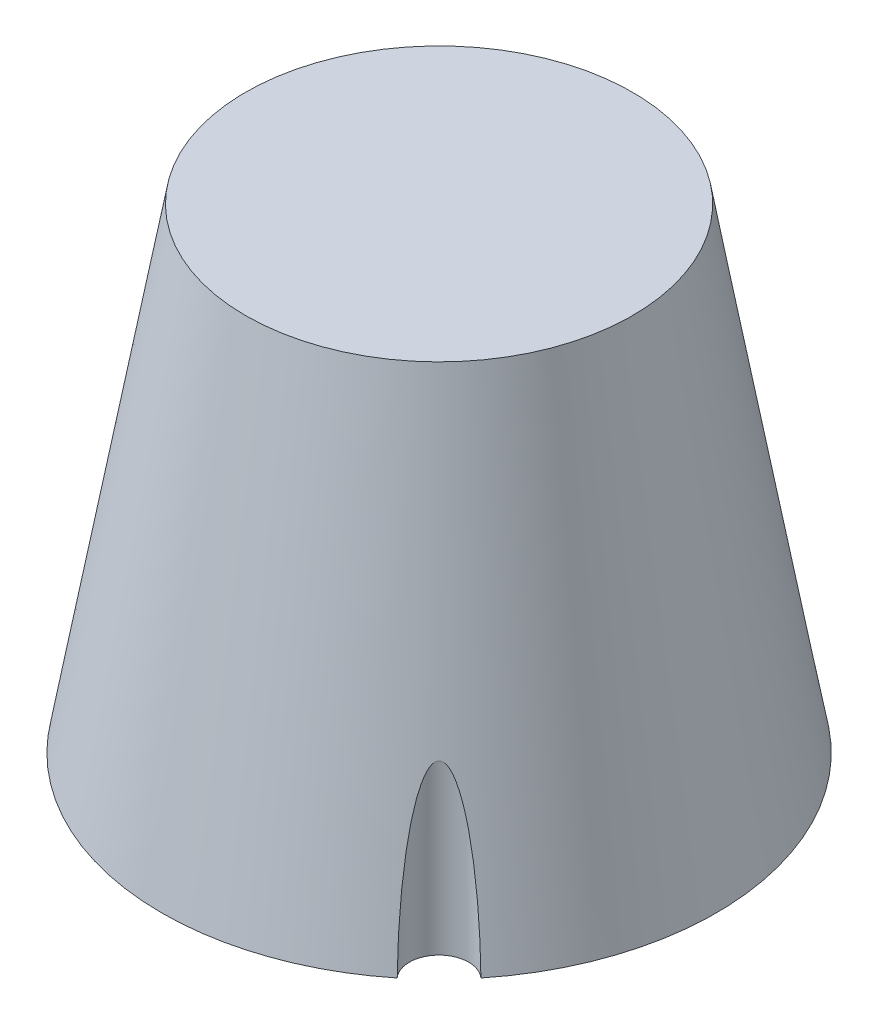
ISO-10303-21;
HEADER;
FILE_DESCRIPTION(('STEP AP214'),'2;1');
FILE_NAME('part.step','',(''),(''),'','','');
FILE_SCHEMA(('AUTOMOTIVE_DESIGN { 1 0 10303 214 1 1 1 1 }'));
ENDSEC;
DATA;
#1=APPLICATION_CONTEXT('core data for automotive mechanical design processes');
#2=APPLICATION_PROTOCOL_DEFINITION('international standard','automotive_design',2000,#1);
#3=PRODUCT_CONTEXT('',#1,'mechanical');
#4=PRODUCT('Part','Part','',(#3));
#5=PRODUCT_RELATED_PRODUCT_CATEGORY('part','',(#4));
#6=PRODUCT_DEFINITION_FORMATION('','',#4);
#7=PRODUCT_DEFINITION_CONTEXT('part definition',#1,'design');
#8=PRODUCT_DEFINITION('design','',#6,#7);
#9=PRODUCT_DEFINITION_SHAPE('','',#8);
#10=(LENGTH_UNIT() NAMED_UNIT(*) SI_UNIT(.MILLI.,.METRE.));
#11=(NAMED_UNIT(*) PLANE_ANGLE_UNIT() SI_UNIT($,.RADIAN.));
#12=(NAMED_UNIT(*) SI_UNIT($,.STERADIAN.) SOLID_ANGLE_UNIT());
#13=UNCERTAINTY_MEASURE_WITH_UNIT(LENGTH_MEASURE(1.E-05),#10,'distance_accuracy_value','');
#14=(GEOMETRIC_REPRESENTATION_CONTEXT(3) GLOBAL_UNCERTAINTY_ASSIGNED_CONTEXT((#13)) GLOBAL_UNIT_ASSIGNED_CONTEXT((#10,
#11,#12)) REPRESENTATION_CONTEXT('',''));
#15=CARTESIAN_POINT('',(0.,0.,0.));
#16=DIRECTION('',(0.,0.,1.));
#17=DIRECTION('',(1.,0.,0.));
#18=AXIS2_PLACEMENT_3D('',#15,#16,#17);
#19=CARTESIAN_POINT('',(0.,0.,0.));
#20=DIRECTION('',(0.,-1.,0.));
#21=DIRECTION('',(0.,0.,1.));
#22=AXIS2_PLACEMENT_3D('',#19,#20,#21);
#23=CONICAL_SURFACE('',#22,35.,0.174532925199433);
#24=CARTESIAN_POINT('',(0.,60.,0.));
#25=DIRECTION('',(0.,1.,0.));
#26=DIRECTION('',(0.,0.,1.));
#27=AXIS2_PLACEMENT_3D('',#24,#25,#26);
#28=CIRCLE('',#27,24.4203811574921);
#29=CARTESIAN_POINT('',(0.,60.,24.4203811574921));
#30=VERTEX_POINT('',#29);
#31=EDGE_CURVE('E41',#30,#30,#28,.T.);
#32=ORIENTED_EDGE('',*,*,#31,.F.);
#33=EDGE_LOOP('',(#32));
#34=FACE_BOUND('',#33,.T.);
#35=CARTESIAN_POINT('',(0.,0.,0.));
#36=DIRECTION('',(0.,1.,0.));
#37=DIRECTION('',(0.,0.,1.));
#38=AXIS2_PLACEMENT_3D('',#35,#36,#37);
#39=CIRCLE('',#38,35.);
#40=CARTESIAN_POINT('',(27.2492172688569,0.,21.9654309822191));
#41=VERTEX_POINT('',#40);
#42=CARTESIAN_POINT('',(21.9654309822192,0.,27.2492172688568));
#43=VERTEX_POINT('',#42);
#44=EDGE_CURVE('E53',#41,#43,#39,.T.);
#45=ORIENTED_EDGE('',*,*,#44,.T.);
#46=CARTESIAN_POINT('',(21.9654545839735,-0.0002,27.2492435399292));
#47=CARTESIAN_POINT('',(21.893009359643,0.613919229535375,27.1685491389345));
#48=CARTESIAN_POINT('',(21.8241814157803,1.22808387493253,27.0849372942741));
#49=CARTESIAN_POINT('',(21.6938730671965,2.45638624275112,26.9117940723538));
#50=CARTESIAN_POINT('',(21.6323929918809,3.07052396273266,26.8222624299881));
#51=CARTESIAN_POINT('',(21.5168357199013,4.29928181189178,26.637099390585));
#52=CARTESIAN_POINT('',(21.4627668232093,4.91390171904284,26.5414613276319));
#53=CARTESIAN_POINT('',(21.3624446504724,6.14275649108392,26.3438858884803));
#54=CARTESIAN_POINT('',(21.3161912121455,6.75699136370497,26.2419486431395));
#55=CARTESIAN_POINT('',(21.2320367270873,7.98493636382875,26.0312685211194));
#56=CARTESIAN_POINT('',(21.1941365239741,8.59864643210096,25.9225249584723));
#57=CARTESIAN_POINT('',(21.1275576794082,9.82521374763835,25.6974367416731));
#58=CARTESIAN_POINT('',(21.0988795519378,10.438070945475,25.5810916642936));
#59=CARTESIAN_POINT('',(21.0520813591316,11.662378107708,25.3395878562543));
#60=CARTESIAN_POINT('',(21.0339596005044,12.2738282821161,25.2144305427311));
#61=CARTESIAN_POINT('',(21.0163562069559,13.189404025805,25.0185418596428));
#62=CARTESIAN_POINT('',(21.0120849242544,13.4943143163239,24.9518903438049));
#63=CARTESIAN_POINT('',(21.007159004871,14.1034647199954,24.8154758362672));
#64=CARTESIAN_POINT('',(21.0065042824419,14.4077048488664,24.7457129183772));
#65=CARTESIAN_POINT('',(21.0093592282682,15.0155061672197,24.602527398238));
#66=CARTESIAN_POINT('',(21.0128714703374,15.3190668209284,24.5291025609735));
#67=CARTESIAN_POINT('',(21.0248349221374,15.9250565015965,24.3779200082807));
#68=CARTESIAN_POINT('',(21.0332866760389,16.2274854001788,24.300161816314));
#69=CARTESIAN_POINT('',(21.0562609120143,16.8306741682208,24.139299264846));
#70=CARTESIAN_POINT('',(21.0707829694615,17.1314341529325,24.0561952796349));
#71=CARTESIAN_POINT('',(21.1076159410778,17.7304561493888,23.8831053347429));
#72=CARTESIAN_POINT('',(21.1299246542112,18.0287188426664,23.7931213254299));
#73=CARTESIAN_POINT('',(21.1715484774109,18.4733350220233,23.6508617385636));
#74=CARTESIAN_POINT('',(21.186801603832,18.6212166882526,23.6021781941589));
#75=CARTESIAN_POINT('',(21.220673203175,18.9156369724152,23.5018307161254));
#76=CARTESIAN_POINT('',(21.2392925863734,19.0621752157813,23.4501659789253));
#77=CARTESIAN_POINT('',(21.2807874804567,19.3532966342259,23.3431006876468));
#78=CARTESIAN_POINT('',(21.3036633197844,19.4978796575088,23.2876998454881));
#79=CARTESIAN_POINT('',(21.3550313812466,19.7840394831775,23.1720347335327));
#80=CARTESIAN_POINT('',(21.3835199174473,19.9256181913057,23.1117736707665));
#81=CARTESIAN_POINT('',(21.4323543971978,20.1346274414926,23.0160882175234));
#82=CARTESIAN_POINT('',(21.4497049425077,20.2039207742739,22.9832143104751));
#83=CARTESIAN_POINT('',(21.4869285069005,20.3407626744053,22.9153523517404));
#84=CARTESIAN_POINT('',(21.5068007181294,20.4083117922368,22.8803649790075));
#85=CARTESIAN_POINT('',(21.5497733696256,20.5410635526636,22.8077034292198));
#86=CARTESIAN_POINT('',(21.5728786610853,20.6062624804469,22.7700252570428));
#87=CARTESIAN_POINT('',(21.6232796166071,20.7328773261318,22.6913388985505));
#88=CARTESIAN_POINT('',(21.6505694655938,20.7942983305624,22.6503353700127));
#89=CARTESIAN_POINT('',(21.7112733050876,20.9120374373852,22.5633560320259));
#90=CARTESIAN_POINT('',(21.7447741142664,20.9682637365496,22.51731409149));
#91=CARTESIAN_POINT('',(21.8197577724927,21.0693547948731,22.4197913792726));
#92=CARTESIAN_POINT('',(21.8611598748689,21.1143246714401,22.3683678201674));
#93=CARTESIAN_POINT('',(21.9283464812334,21.1647192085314,22.2899535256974));
#94=CARTESIAN_POINT('',(21.9502805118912,21.1783179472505,22.2649902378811));
#95=CARTESIAN_POINT('',(21.9960160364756,21.2001247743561,22.2143973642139));
#96=CARTESIAN_POINT('',(22.0198159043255,21.2083374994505,22.1887683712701));
#97=CARTESIAN_POINT('',(22.0689642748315,21.2184753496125,22.1373621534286));
#98=CARTESIAN_POINT('',(22.0943223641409,21.220356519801,22.1115851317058));
#99=CARTESIAN_POINT('',(22.1455895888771,21.2174464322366,22.0609660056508));
#100=CARTESIAN_POINT('',(22.1714989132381,21.2126528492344,22.0361242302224));
#101=CARTESIAN_POINT('',(22.2209246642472,21.1976495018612,21.9900401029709));
#102=CARTESIAN_POINT('',(22.2444668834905,21.1879030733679,21.9686687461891));
#103=CARTESIAN_POINT('',(22.290823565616,21.1641634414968,21.9276003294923));
#104=CARTESIAN_POINT('',(22.3136377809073,21.1501688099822,21.9079038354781));
#105=CARTESIAN_POINT('',(22.3760723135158,21.1063844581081,21.8552250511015));
#106=CARTESIAN_POINT('',(22.4146479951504,21.0728780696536,21.8241165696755));
#107=CARTESIAN_POINT('',(22.4886795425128,20.9991015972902,21.766532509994));
#108=CARTESIAN_POINT('',(22.5241227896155,20.9588059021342,21.7400752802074));
#109=CARTESIAN_POINT('',(22.6034200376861,20.8600565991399,21.6828077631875));
#110=CARTESIAN_POINT('',(22.6462331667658,20.7999748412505,21.6534041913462));
#111=CARTESIAN_POINT('',(22.7281780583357,20.675290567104,21.5993027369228));
#112=CARTESIAN_POINT('',(22.7673019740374,20.6106789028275,21.5746147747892));
#113=CARTESIAN_POINT('',(22.8428328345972,20.478230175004,21.5286933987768));
#114=CARTESIAN_POINT('',(22.8792241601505,20.4103777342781,21.5074791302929));
#115=CARTESIAN_POINT('',(22.9496187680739,20.2727556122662,21.4678856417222));
#116=CARTESIAN_POINT('',(22.9836244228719,20.2029879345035,21.4495035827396));
#117=CARTESIAN_POINT('',(23.0805900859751,19.9962824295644,21.398854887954));
#118=CARTESIAN_POINT('',(23.1409695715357,19.8573947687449,21.3696314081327));
#119=CARTESIAN_POINT('',(23.2567496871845,19.5764573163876,21.3169481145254));
#120=CARTESIAN_POINT('',(23.3121468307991,19.4344053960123,21.2934923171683));
#121=CARTESIAN_POINT('',(23.4192512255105,19.147926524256,21.2508825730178));
#122=CARTESIAN_POINT('',(23.4709499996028,19.0034949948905,21.2317383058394));
#123=CARTESIAN_POINT('',(23.5713305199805,18.7131744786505,21.1968752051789));
#124=CARTESIAN_POINT('',(23.6200119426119,18.5672853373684,21.1811567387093));
#125=CARTESIAN_POINT('',(23.7149763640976,18.2742206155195,21.1524901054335));
#126=CARTESIAN_POINT('',(23.7612556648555,18.1270434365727,21.1395461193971));
#127=CARTESIAN_POINT('',(23.8517418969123,17.8318608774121,21.1160004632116));
#128=CARTESIAN_POINT('',(23.8959486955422,17.6838554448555,21.1053989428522));
#129=CARTESIAN_POINT('',(23.9825232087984,17.3874192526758,21.0862146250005));
#130=CARTESIAN_POINT('',(24.0248935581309,17.2389894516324,21.0776288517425));
#131=CARTESIAN_POINT('',(24.1080920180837,16.9416141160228,21.0622004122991));
#132=CARTESIAN_POINT('',(24.1489201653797,16.7926685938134,21.0553577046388));
#133=CARTESIAN_POINT('',(24.2687116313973,16.3476570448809,21.0372314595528));
#134=CARTESIAN_POINT('',(24.3456905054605,16.0509635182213,21.028198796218));
#135=CARTESIAN_POINT('',(24.4953664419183,15.4563826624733,21.0150225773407));
#136=CARTESIAN_POINT('',(24.5680631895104,15.1584952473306,21.0108793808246));
#137=CARTESIAN_POINT('',(24.709887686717,14.5617708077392,21.0067165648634));
#138=CARTESIAN_POINT('',(24.7790145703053,14.2629335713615,21.0066979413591));
#139=CARTESIAN_POINT('',(24.9141860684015,13.6645813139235,21.0102374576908));
#140=CARTESIAN_POINT('',(24.9802306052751,13.3650662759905,21.0137956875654));
#141=CARTESIAN_POINT('',(25.1745144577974,12.4648706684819,21.0292128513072));
#142=CARTESIAN_POINT('',(25.2987037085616,11.8633933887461,21.0458176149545));
#143=CARTESIAN_POINT('',(25.538336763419,10.6591904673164,21.0894332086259));
#144=CARTESIAN_POINT('',(25.6537817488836,10.0564650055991,21.1164426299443));
#145=CARTESIAN_POINT('',(25.8770206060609,8.85103191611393,21.1794797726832));
#146=CARTESIAN_POINT('',(25.9848259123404,8.24832567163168,21.2154936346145));
#147=CARTESIAN_POINT('',(26.1937887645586,7.04228713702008,21.2956898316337));
#148=CARTESIAN_POINT('',(26.2949460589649,6.43895482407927,21.3398724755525));
#149=CARTESIAN_POINT('',(26.4910503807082,5.23230797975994,21.4358166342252));
#150=CARTESIAN_POINT('',(26.586001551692,4.6289937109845,21.4875730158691));
#151=CARTESIAN_POINT('',(26.7700682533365,3.42214355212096,21.598348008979));
#152=CARTESIAN_POINT('',(26.8591838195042,2.81860766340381,21.6573665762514));
#153=CARTESIAN_POINT('',(26.9718358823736,2.03040041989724,21.7390716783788));
#154=CARTESIAN_POINT('',(26.9979578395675,1.84575879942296,21.7585431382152));
#155=CARTESIAN_POINT('',(27.0496695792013,1.47646276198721,21.7981498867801));
#156=CARTESIAN_POINT('',(27.0752593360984,1.29180834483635,21.818285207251));
#157=CARTESIAN_POINT('',(27.1258935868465,0.922587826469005,21.8592077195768));
#158=CARTESIAN_POINT('',(27.1509383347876,0.73802172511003,21.8799945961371));
#159=CARTESIAN_POINT('',(27.2004924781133,0.368902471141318,21.9222288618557));
#160=CARTESIAN_POINT('',(27.2250018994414,0.184349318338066,21.9436762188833));
#161=CARTESIAN_POINT('',(27.2492435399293,-0.000199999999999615,21.9654545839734));
#162=B_SPLINE_CURVE_WITH_KNOTS('',3,(#46,#47,#48,#49,#50,#51,#52,#53,#54,#55,#56,#57,#58,#59,
#60,#61,#62,#63,#64,#65,#66,#67,#68,#69,#70,#71,#72,#73,#74,#75,#76,#77,#78,#79,#80,#81,#82,#83,
#84,#85,#86,#87,#88,#89,#90,#91,#92,#93,#94,#95,#96,#97,#98,#99,#100,#101,#102,#103,#104,#105,
#106,#107,#108,#109,#110,#111,#112,#113,#114,#115,#116,#117,#118,#119,#120,#121,#122,#123,#124,
#125,#126,#127,#128,#129,#130,#131,#132,#133,#134,#135,#136,#137,#138,#139,#140,#141,#142,#143,
#144,#145,#146,#147,#148,#149,#150,#151,#152,#153,#154,#155,#156,#157,#158,#159,#160,#161),
.UNSPECIFIED.,.F.,.F.,(4,2,2,2,2,2,2,2,2,2,2,2,2,2,2,2,2,2,2,2,2,2,2,2,2,2,2,2,2,2,2,2,2,2,2,2,
2,2,2,2,2,2,2,2,2,2,2,2,2,2,2,2,2,2,2,2,2,4),(0.,1.87084649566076,3.74177683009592,
5.61478564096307,7.48775555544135,9.36091454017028,11.2341779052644,13.1071407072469,
14.0435295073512,14.9798961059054,15.9168413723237,16.8538898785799,17.790872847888,
18.7275911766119,19.1968433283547,19.6662225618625,20.1356380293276,20.6047462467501,
20.8405835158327,21.0763454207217,21.3124649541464,21.5482592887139,21.787639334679,
22.0246927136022,22.1320346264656,22.2392840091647,22.3472764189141,22.4553064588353,
22.5547052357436,22.6541374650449,22.8325484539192,23.011648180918,23.2493290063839,
23.487504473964,23.7269514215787,23.9661567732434,24.4284948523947,24.8911539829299,
25.354841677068,25.8185790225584,26.283010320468,26.7474713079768,27.2112422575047,
27.6750021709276,28.594852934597,29.5147712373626,30.4349116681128,31.3550752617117,
33.1980323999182,35.0407401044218,36.8806288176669,38.7205871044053,40.5593040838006,
42.3980098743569,42.9604909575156,43.5229989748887,44.0852388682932,44.6474514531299),.UNSPECIFIED.);
#163=EDGE_CURVE('E47',#43,#41,#162,.T.);
#164=ORIENTED_EDGE('',*,*,#163,.T.);
#165=EDGE_LOOP('',(#45,#164));
#166=FACE_BOUND('',#165,.T.);
#167=ADVANCED_FACE('F33',(#34,#166),#23,.T.);
#168=CARTESIAN_POINT('',(0.,60.,0.));
#169=DIRECTION('',(0.,1.,0.));
#170=DIRECTION('',(0.,0.,1.));
#171=AXIS2_PLACEMENT_3D('',#168,#169,#170);
#172=PLANE('',#171);
#173=ORIENTED_EDGE('',*,*,#31,.T.);
#174=EDGE_LOOP('',(#173));
#175=FACE_BOUND('',#174,.T.);
#176=ADVANCED_FACE('F66',(#175),#172,.T.);
#177=CARTESIAN_POINT('',(0.,0.,0.));
#178=DIRECTION('',(0.,1.,0.));
#179=DIRECTION('',(0.,0.,1.));
#180=AXIS2_PLACEMENT_3D('',#177,#178,#179);
#181=PLANE('',#180);
#182=ORIENTED_EDGE('',*,*,#44,.F.);
#183=CARTESIAN_POINT('',(24.7487373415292,0.,24.7487373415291));
#184=DIRECTION('',(0.,1.,0.));
#185=DIRECTION('',(0.,0.,1.));
#186=AXIS2_PLACEMENT_3D('',#183,#184,#185);
#187=CIRCLE('',#186,3.74154969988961);
#188=EDGE_CURVE('E11',#41,#43,#187,.T.);
#189=ORIENTED_EDGE('',*,*,#188,.T.);
#190=EDGE_LOOP('',(#182,#189));
#191=FACE_BOUND('',#190,.T.);
#192=ADVANCED_FACE('F55',(#191),#181,.F.);
#193=CARTESIAN_POINT('',(24.7487373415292,60.,24.7487373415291));
#194=DIRECTION('',(0.,-1.,0.));
#195=DIRECTION('',(0.,0.,-1.));
#196=AXIS2_PLACEMENT_3D('',#193,#194,#195);
#197=CYLINDRICAL_SURFACE('',#196,3.74154969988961);
#198=ORIENTED_EDGE('',*,*,#188,.F.);
#199=ORIENTED_EDGE('',*,*,#163,.F.);
#200=EDGE_LOOP('',(#198,#199));
#201=FACE_BOUND('',#200,.T.);
#202=ADVANCED_FACE('F48',(#201),#197,.F.);
#203=CLOSED_SHELL('',(#167,#176,#192,#202));
#204=MANIFOLD_SOLID_BREP('B2',#203);
#205=ADVANCED_BREP_SHAPE_REPRESENTATION('',(#18,#204),#14);
#206=SHAPE_DEFINITION_REPRESENTATION(#9,#205);
ENDSEC;
END-ISO-10303-21;
